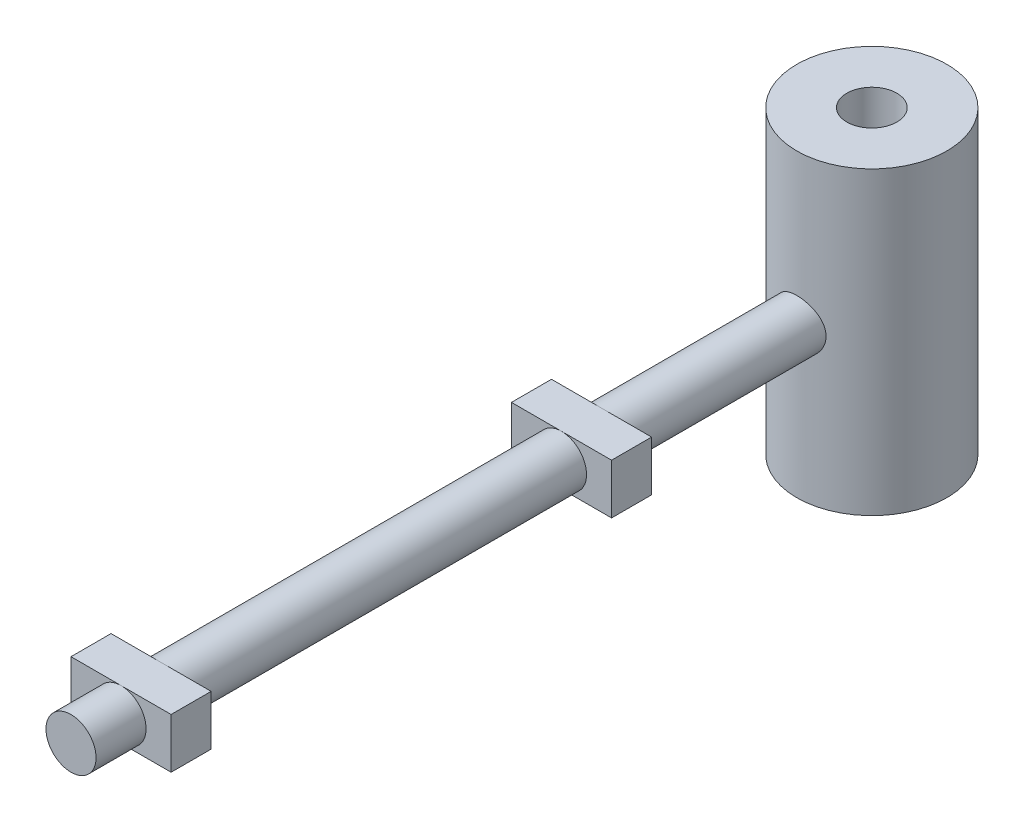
from build123d import *

# Parameters (mm, degrees)
ESQUISSE1_R             = 2.5
BASE_EXTRUSION_DEPTH    = 5
ESQUISSE2_W             = 10
ESQUISSE2_H             = 5
BOSS_EXTRU_1_DEPTH      = 4
BOSS_EXTRU_2_START      = 40
BOSS_EXTRU_2_DEPTH      = 40
ESQUISSE4_W             = 10
ESQUISSE4_H             = 5
BOSS_EXTRU_3_DEPTH      = 4
BOSS_EXTRU_4_START      = 27
BOSS_EXTRU_4_DEPTH      = 27
BOSS_EXTRU_5_DEPTH      = 15
BOSS_EXTRU_5_DEPTH_BACK = 15
ESQUISSE6_R             = 7.5
ESQUISSE7_R             = 2.5
ENL_V_MAT_EXTRU_1_DEPTH = 33


with BuildPart() as part:
    # Esquisse1 → Base-Extrusion (new body)
    with BuildSketch(Plane.XY):
        Circle(ESQUISSE1_R)
    extrude(amount=BASE_EXTRUSION_DEPTH)

    # Esquisse2 → Boss.-Extru.1 (add)
    with BuildSketch(Plane(origin=(0, 0, 0), x_dir=(-1, 0, 0), z_dir=(0, 0, -1))):
        Rectangle(ESQUISSE2_W, ESQUISSE2_H)
    extrude(amount=BOSS_EXTRU_1_DEPTH)

    # Esquisse3 → Boss.-Extru.2 (add)
    with BuildSketch(Plane(origin=(0, 0, -4), x_dir=(-1, 0, 0), z_dir=(0, 0, -1)).offset(BOSS_EXTRU_2_START)):
        with BuildLine():
            ThreePointArc((0, -2.5), (2.5, 0), (0, 2.5))
            ThreePointArc((0, 2.5), (-2.5, 0), (0, -2.5))
        make_face()
    extrude(amount=-BOSS_EXTRU_2_DEPTH)

    # Esquisse4 → Boss.-Extru.3 (add)
    with BuildSketch(Plane(origin=(0, 0, -44), x_dir=(-1, 0, 0), z_dir=(0, 0, -1))):
        Rectangle(ESQUISSE4_W, ESQUISSE4_H)
    extrude(amount=BOSS_EXTRU_3_DEPTH)

    # Esquisse5 → Boss.-Extru.4 (add)
    with BuildSketch(Plane(origin=(0, 0, -48), x_dir=(-1, 0, 0), z_dir=(0, 0, -1)).offset(BOSS_EXTRU_4_START)):
        with BuildLine():
            ThreePointArc((0, -2.5), (2.5, 0), (0, 2.5))
            ThreePointArc((0, 2.5), (-2.5, 0), (0, -2.5))
        make_face()
    extrude(amount=-BOSS_EXTRU_4_DEPTH)

    # Esquisse6 → Boss.-Extru.5 (add, two sides: drawn at the far end of the back side and taken through both)
    with BuildSketch(Plane(origin=(0, 0, 0), x_dir=(1, 0, 0), z_dir=(0, 1, 0)).offset(-BOSS_EXTRU_5_DEPTH_BACK)):
        with Locations(Location((0, 75, 0), (0, 0, 270))):
            Circle(ESQUISSE6_R)
    extrude(amount=BOSS_EXTRU_5_DEPTH + BOSS_EXTRU_5_DEPTH_BACK)

    # Esquisse7 → Enl_v. mat.-Extru.1 (cut)
    with BuildSketch(Plane(origin=(0, 15, 0), x_dir=(-1, 0, 0), z_dir=(0, 1, 0))):
        with Locations(Location((0, -75, 0), (0, 0, 90))):
            Circle(ESQUISSE7_R)
    extrude(amount=-ENL_V_MAT_EXTRU_1_DEPTH, mode=Mode.SUBTRACT)


solid = part.part
